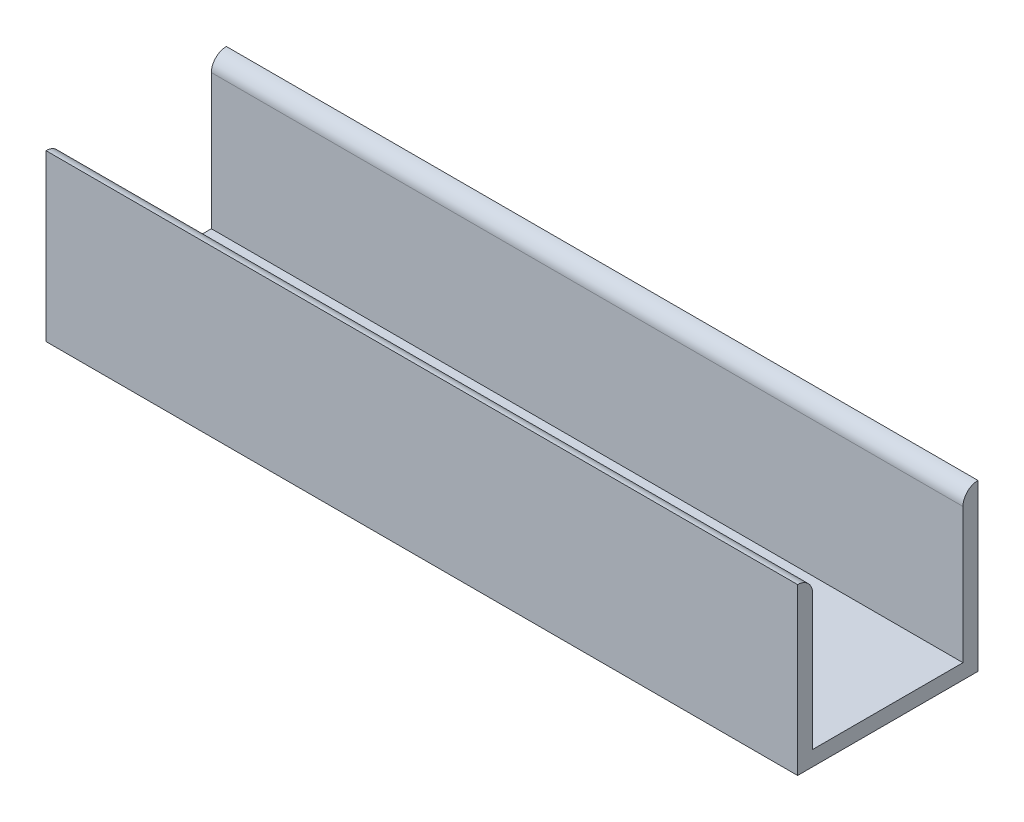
ISO-10303-21;
HEADER;
FILE_DESCRIPTION(('STEP AP214'),'2;1');
FILE_NAME('part.step','',(''),(''),'','','');
FILE_SCHEMA(('AUTOMOTIVE_DESIGN { 1 0 10303 214 1 1 1 1 }'));
ENDSEC;
DATA;
#1=APPLICATION_CONTEXT('core data for automotive mechanical design processes');
#2=APPLICATION_PROTOCOL_DEFINITION('international standard','automotive_design',2000,#1);
#3=PRODUCT_CONTEXT('',#1,'mechanical');
#4=PRODUCT('Part','Part','',(#3));
#5=PRODUCT_RELATED_PRODUCT_CATEGORY('part','',(#4));
#6=PRODUCT_DEFINITION_FORMATION('','',#4);
#7=PRODUCT_DEFINITION_CONTEXT('part definition',#1,'design');
#8=PRODUCT_DEFINITION('design','',#6,#7);
#9=PRODUCT_DEFINITION_SHAPE('','',#8);
#10=(LENGTH_UNIT() NAMED_UNIT(*) SI_UNIT(.MILLI.,.METRE.));
#11=(NAMED_UNIT(*) PLANE_ANGLE_UNIT() SI_UNIT($,.RADIAN.));
#12=(NAMED_UNIT(*) SI_UNIT($,.STERADIAN.) SOLID_ANGLE_UNIT());
#13=UNCERTAINTY_MEASURE_WITH_UNIT(LENGTH_MEASURE(1.E-05),#10,'distance_accuracy_value','');
#14=(GEOMETRIC_REPRESENTATION_CONTEXT(3) GLOBAL_UNCERTAINTY_ASSIGNED_CONTEXT((#13)) GLOBAL_UNIT_ASSIGNED_CONTEXT((#10,
#11,#12)) REPRESENTATION_CONTEXT('',''));
#15=CARTESIAN_POINT('',(0.,0.,0.));
#16=DIRECTION('',(0.,0.,1.));
#17=DIRECTION('',(1.,0.,0.));
#18=AXIS2_PLACEMENT_3D('',#15,#16,#17);
#19=CARTESIAN_POINT('',(-1000.,0.,-120.));
#20=DIRECTION('',(0.,0.,-1.));
#21=DIRECTION('',(-1.,0.,0.));
#22=AXIS2_PLACEMENT_3D('',#19,#20,#21);
#23=PLANE('',#22);
#24=DIRECTION('',(0.,1.,0.));
#25=VECTOR('',#24,1.);
#26=CARTESIAN_POINT('',(0.,0.,-120.));
#27=LINE('',#26,#25);
#28=CARTESIAN_POINT('',(0.,-20.,-120.));
#29=VERTEX_POINT('',#28);
#30=CARTESIAN_POINT('',(0.,200.,-120.));
#31=VERTEX_POINT('',#30);
#32=EDGE_CURVE('E104',#29,#31,#27,.T.);
#33=ORIENTED_EDGE('',*,*,#32,.F.);
#34=DIRECTION('',(1.,0.,0.));
#35=VECTOR('',#34,1.);
#36=CARTESIAN_POINT('',(-1000.,-20.,-120.));
#37=LINE('',#36,#35);
#38=CARTESIAN_POINT('',(-1000.,-20.,-120.));
#39=VERTEX_POINT('',#38);
#40=EDGE_CURVE('E139',#39,#29,#37,.T.);
#41=ORIENTED_EDGE('',*,*,#40,.F.);
#42=DIRECTION('',(0.,1.,0.));
#43=VECTOR('',#42,1.);
#44=CARTESIAN_POINT('',(-1000.,0.,-120.));
#45=LINE('',#44,#43);
#46=CARTESIAN_POINT('',(-1000.,200.,-120.));
#47=VERTEX_POINT('',#46);
#48=EDGE_CURVE('E107',#39,#47,#45,.T.);
#49=ORIENTED_EDGE('',*,*,#48,.T.);
#50=DIRECTION('',(1.,0.,0.));
#51=VECTOR('',#50,1.);
#52=CARTESIAN_POINT('',(-1000.,200.,-120.));
#53=LINE('',#52,#51);
#54=EDGE_CURVE('E97',#47,#31,#53,.T.);
#55=ORIENTED_EDGE('',*,*,#54,.T.);
#56=EDGE_LOOP('',(#33,#41,#49,#55));
#57=FACE_BOUND('',#56,.T.);
#58=ADVANCED_FACE('F31',(#57),#23,.T.);
#59=CARTESIAN_POINT('',(-1000.,-20.,100.));
#60=DIRECTION('',(0.,-1.,0.));
#61=DIRECTION('',(0.,0.,-1.));
#62=AXIS2_PLACEMENT_3D('',#59,#60,#61);
#63=PLANE('',#62);
#64=DIRECTION('',(0.,0.,-1.));
#65=VECTOR('',#64,1.);
#66=CARTESIAN_POINT('',(0.,-20.,100.));
#67=LINE('',#66,#65);
#68=CARTESIAN_POINT('',(0.,-20.,120.));
#69=VERTEX_POINT('',#68);
#70=EDGE_CURVE('E115',#69,#29,#67,.T.);
#71=ORIENTED_EDGE('',*,*,#70,.F.);
#72=DIRECTION('',(1.,0.,0.));
#73=VECTOR('',#72,1.);
#74=CARTESIAN_POINT('',(-1000.,-20.,120.));
#75=LINE('',#74,#73);
#76=CARTESIAN_POINT('',(-1000.,-20.,120.));
#77=VERTEX_POINT('',#76);
#78=EDGE_CURVE('E141',#77,#69,#75,.T.);
#79=ORIENTED_EDGE('',*,*,#78,.F.);
#80=DIRECTION('',(0.,0.,-1.));
#81=VECTOR('',#80,1.);
#82=CARTESIAN_POINT('',(-1000.,-20.,100.));
#83=LINE('',#82,#81);
#84=EDGE_CURVE('E109',#77,#39,#83,.T.);
#85=ORIENTED_EDGE('',*,*,#84,.T.);
#86=ORIENTED_EDGE('',*,*,#40,.T.);
#87=EDGE_LOOP('',(#71,#79,#85,#86));
#88=FACE_BOUND('',#87,.T.);
#89=ADVANCED_FACE('F173',(#88),#63,.T.);
#90=CARTESIAN_POINT('',(-1000.,200.,120.));
#91=DIRECTION('',(0.,0.,1.));
#92=DIRECTION('',(1.,0.,0.));
#93=AXIS2_PLACEMENT_3D('',#90,#91,#92);
#94=PLANE('',#93);
#95=DIRECTION('',(0.,1.,0.));
#96=VECTOR('',#95,1.);
#97=CARTESIAN_POINT('',(0.,200.,120.));
#98=LINE('',#97,#96);
#99=CARTESIAN_POINT('',(0.,200.,120.));
#100=VERTEX_POINT('',#99);
#101=EDGE_CURVE('E124',#100,#69,#98,.F.);
#102=ORIENTED_EDGE('',*,*,#101,.F.);
#103=DIRECTION('',(1.,0.,0.));
#104=VECTOR('',#103,1.);
#105=CARTESIAN_POINT('',(-1000.,200.,120.));
#106=LINE('',#105,#104);
#107=CARTESIAN_POINT('',(-1000.,200.,120.));
#108=VERTEX_POINT('',#107);
#109=EDGE_CURVE('E143',#108,#100,#106,.T.);
#110=ORIENTED_EDGE('',*,*,#109,.F.);
#111=DIRECTION('',(0.,1.,0.));
#112=VECTOR('',#111,1.);
#113=CARTESIAN_POINT('',(-1000.,200.,120.));
#114=LINE('',#113,#112);
#115=EDGE_CURVE('E134',#108,#77,#114,.F.);
#116=ORIENTED_EDGE('',*,*,#115,.T.);
#117=ORIENTED_EDGE('',*,*,#78,.T.);
#118=EDGE_LOOP('',(#102,#110,#116,#117));
#119=FACE_BOUND('',#118,.T.);
#120=ADVANCED_FACE('F171',(#119),#94,.T.);
#121=CARTESIAN_POINT('',(-1000.,200.,100.));
#122=DIRECTION('',(0.,0.,1.));
#123=DIRECTION('',(1.,0.,0.));
#124=AXIS2_PLACEMENT_3D('',#121,#122,#123);
#125=PLANE('',#124);
#126=DIRECTION('',(0.,-1.,0.));
#127=VECTOR('',#126,1.);
#128=CARTESIAN_POINT('',(-1000.,200.,100.));
#129=LINE('',#128,#127);
#130=CARTESIAN_POINT('',(-1000.,180.,100.));
#131=VERTEX_POINT('',#130);
#132=CARTESIAN_POINT('',(-1000.,0.,100.));
#133=VERTEX_POINT('',#132);
#134=EDGE_CURVE('E132',#131,#133,#129,.T.);
#135=ORIENTED_EDGE('',*,*,#134,.F.);
#136=DIRECTION('',(1.,0.,0.));
#137=VECTOR('',#136,1.);
#138=CARTESIAN_POINT('',(-1000.,180.,100.));
#139=LINE('',#138,#137);
#140=CARTESIAN_POINT('',(0.,180.,100.));
#141=VERTEX_POINT('',#140);
#142=EDGE_CURVE('E99',#131,#141,#139,.T.);
#143=ORIENTED_EDGE('',*,*,#142,.T.);
#144=DIRECTION('',(0.,-1.,0.));
#145=VECTOR('',#144,1.);
#146=CARTESIAN_POINT('',(0.,200.,100.));
#147=LINE('',#146,#145);
#148=CARTESIAN_POINT('',(0.,0.,100.));
#149=VERTEX_POINT('',#148);
#150=EDGE_CURVE('E122',#141,#149,#147,.T.);
#151=ORIENTED_EDGE('',*,*,#150,.T.);
#152=DIRECTION('',(1.,0.,0.));
#153=VECTOR('',#152,1.);
#154=CARTESIAN_POINT('',(-1000.,0.,100.));
#155=LINE('',#154,#153);
#156=EDGE_CURVE('E146',#133,#149,#155,.T.);
#157=ORIENTED_EDGE('',*,*,#156,.F.);
#158=EDGE_LOOP('',(#135,#143,#151,#157));
#159=FACE_BOUND('',#158,.T.);
#160=ADVANCED_FACE('F165',(#159),#125,.F.);
#161=CARTESIAN_POINT('',(-1000.,0.,100.));
#162=DIRECTION('',(0.,-1.,0.));
#163=DIRECTION('',(0.,0.,-1.));
#164=AXIS2_PLACEMENT_3D('',#161,#162,#163);
#165=PLANE('',#164);
#166=DIRECTION('',(0.,0.,-1.));
#167=VECTOR('',#166,1.);
#168=CARTESIAN_POINT('',(0.,0.,100.));
#169=LINE('',#168,#167);
#170=CARTESIAN_POINT('',(0.,0.,-100.));
#171=VERTEX_POINT('',#170);
#172=EDGE_CURVE('E118',#149,#171,#169,.T.);
#173=ORIENTED_EDGE('',*,*,#172,.T.);
#174=DIRECTION('',(1.,0.,0.));
#175=VECTOR('',#174,1.);
#176=CARTESIAN_POINT('',(-1000.,0.,-100.));
#177=LINE('',#176,#175);
#178=CARTESIAN_POINT('',(-1000.,0.,-100.));
#179=VERTEX_POINT('',#178);
#180=EDGE_CURVE('E108',#179,#171,#177,.T.);
#181=ORIENTED_EDGE('',*,*,#180,.F.);
#182=DIRECTION('',(0.,0.,-1.));
#183=VECTOR('',#182,1.);
#184=CARTESIAN_POINT('',(-1000.,0.,100.));
#185=LINE('',#184,#183);
#186=EDGE_CURVE('E130',#133,#179,#185,.T.);
#187=ORIENTED_EDGE('',*,*,#186,.F.);
#188=ORIENTED_EDGE('',*,*,#156,.T.);
#189=EDGE_LOOP('',(#173,#181,#187,#188));
#190=FACE_BOUND('',#189,.T.);
#191=ADVANCED_FACE('F177',(#190),#165,.F.);
#192=CARTESIAN_POINT('',(-1000.,0.,-100.));
#193=DIRECTION('',(0.,0.,-1.));
#194=DIRECTION('',(-1.,0.,0.));
#195=AXIS2_PLACEMENT_3D('',#192,#193,#194);
#196=PLANE('',#195);
#197=DIRECTION('',(0.,1.,0.));
#198=VECTOR('',#197,1.);
#199=CARTESIAN_POINT('',(0.,0.,-100.));
#200=LINE('',#199,#198);
#201=CARTESIAN_POINT('',(0.,180.,-100.));
#202=VERTEX_POINT('',#201);
#203=EDGE_CURVE('E116',#171,#202,#200,.T.);
#204=ORIENTED_EDGE('',*,*,#203,.T.);
#205=DIRECTION('',(1.,0.,0.));
#206=VECTOR('',#205,1.);
#207=CARTESIAN_POINT('',(-1000.,180.,-100.));
#208=LINE('',#207,#206);
#209=CARTESIAN_POINT('',(-1000.,180.,-100.));
#210=VERTEX_POINT('',#209);
#211=EDGE_CURVE('E11',#202,#210,#208,.F.);
#212=ORIENTED_EDGE('',*,*,#211,.T.);
#213=DIRECTION('',(0.,1.,0.));
#214=VECTOR('',#213,1.);
#215=CARTESIAN_POINT('',(-1000.,0.,-100.));
#216=LINE('',#215,#214);
#217=EDGE_CURVE('E128',#179,#210,#216,.T.);
#218=ORIENTED_EDGE('',*,*,#217,.F.);
#219=ORIENTED_EDGE('',*,*,#180,.T.);
#220=EDGE_LOOP('',(#204,#212,#218,#219));
#221=FACE_BOUND('',#220,.T.);
#222=ADVANCED_FACE('F175',(#221),#196,.F.);
#223=CARTESIAN_POINT('',(-1000.,200.,-120.));
#224=DIRECTION('',(-1.,0.,0.));
#225=DIRECTION('',(0.,0.,1.));
#226=AXIS2_PLACEMENT_3D('',#223,#224,#225);
#227=PLANE('',#226);
#228=ORIENTED_EDGE('',*,*,#115,.F.);
#229=CARTESIAN_POINT('',(-1000.,180.,120.));
#230=DIRECTION('',(-1.,0.,0.));
#231=DIRECTION('',(0.,0.,1.));
#232=AXIS2_PLACEMENT_3D('',#229,#230,#231);
#233=CIRCLE('',#232,20.);
#234=EDGE_CURVE('E38',#108,#131,#233,.T.);
#235=ORIENTED_EDGE('',*,*,#234,.T.);
#236=ORIENTED_EDGE('',*,*,#134,.T.);
#237=ORIENTED_EDGE('',*,*,#186,.T.);
#238=ORIENTED_EDGE('',*,*,#217,.T.);
#239=CARTESIAN_POINT('',(-1000.,180.,-120.));
#240=DIRECTION('',(-1.,0.,0.));
#241=DIRECTION('',(0.,0.,1.));
#242=AXIS2_PLACEMENT_3D('',#239,#240,#241);
#243=CIRCLE('',#242,20.);
#244=EDGE_CURVE('E154',#210,#47,#243,.T.);
#245=ORIENTED_EDGE('',*,*,#244,.T.);
#246=ORIENTED_EDGE('',*,*,#48,.F.);
#247=ORIENTED_EDGE('',*,*,#84,.F.);
#248=EDGE_LOOP('',(#228,#235,#236,#237,#238,#245,#246,#247));
#249=FACE_BOUND('',#248,.T.);
#250=ADVANCED_FACE('F159',(#249),#227,.T.);
#251=CARTESIAN_POINT('',(0.,200.,-120.));
#252=DIRECTION('',(-1.,0.,0.));
#253=DIRECTION('',(0.,0.,1.));
#254=AXIS2_PLACEMENT_3D('',#251,#252,#253);
#255=PLANE('',#254);
#256=ORIENTED_EDGE('',*,*,#150,.F.);
#257=CARTESIAN_POINT('',(0.,180.,120.));
#258=DIRECTION('',(-1.,0.,0.));
#259=DIRECTION('',(0.,0.,1.));
#260=AXIS2_PLACEMENT_3D('',#257,#258,#259);
#261=CIRCLE('',#260,20.);
#262=EDGE_CURVE('E98',#141,#100,#261,.F.);
#263=ORIENTED_EDGE('',*,*,#262,.T.);
#264=ORIENTED_EDGE('',*,*,#101,.T.);
#265=ORIENTED_EDGE('',*,*,#70,.T.);
#266=ORIENTED_EDGE('',*,*,#32,.T.);
#267=CARTESIAN_POINT('',(0.,180.,-120.));
#268=DIRECTION('',(-1.,0.,0.));
#269=DIRECTION('',(0.,0.,1.));
#270=AXIS2_PLACEMENT_3D('',#267,#268,#269);
#271=CIRCLE('',#270,20.);
#272=EDGE_CURVE('E51',#31,#202,#271,.F.);
#273=ORIENTED_EDGE('',*,*,#272,.T.);
#274=ORIENTED_EDGE('',*,*,#203,.F.);
#275=ORIENTED_EDGE('',*,*,#172,.F.);
#276=EDGE_LOOP('',(#256,#263,#264,#265,#266,#273,#274,#275));
#277=FACE_BOUND('',#276,.T.);
#278=ADVANCED_FACE('F112',(#277),#255,.F.);
#279=CARTESIAN_POINT('',(-1000.,180.,120.));
#280=DIRECTION('',(1.,0.,0.));
#281=DIRECTION('',(0.,0.,-1.));
#282=AXIS2_PLACEMENT_3D('',#279,#280,#281);
#283=CYLINDRICAL_SURFACE('',#282,20.);
#284=ORIENTED_EDGE('',*,*,#234,.F.);
#285=ORIENTED_EDGE('',*,*,#109,.T.);
#286=ORIENTED_EDGE('',*,*,#262,.F.);
#287=ORIENTED_EDGE('',*,*,#142,.F.);
#288=EDGE_LOOP('',(#284,#285,#286,#287));
#289=FACE_BOUND('',#288,.T.);
#290=ADVANCED_FACE('F167',(#289),#283,.T.);
#291=CARTESIAN_POINT('',(-1000.,180.,-120.));
#292=DIRECTION('',(1.,0.,0.));
#293=DIRECTION('',(0.,0.,-1.));
#294=AXIS2_PLACEMENT_3D('',#291,#292,#293);
#295=CYLINDRICAL_SURFACE('',#294,20.);
#296=ORIENTED_EDGE('',*,*,#244,.F.);
#297=ORIENTED_EDGE('',*,*,#211,.F.);
#298=ORIENTED_EDGE('',*,*,#272,.F.);
#299=ORIENTED_EDGE('',*,*,#54,.F.);
#300=EDGE_LOOP('',(#296,#297,#298,#299));
#301=FACE_BOUND('',#300,.T.);
#302=ADVANCED_FACE('F96',(#301),#295,.T.);
#303=CLOSED_SHELL('',(#58,#89,#120,#160,#191,#222,#250,#278,#290,#302));
#304=MANIFOLD_SOLID_BREP('B2',#303);
#305=ADVANCED_BREP_SHAPE_REPRESENTATION('',(#18,#304),#14);
#306=SHAPE_DEFINITION_REPRESENTATION(#9,#305);
ENDSEC;
END-ISO-10303-21;
